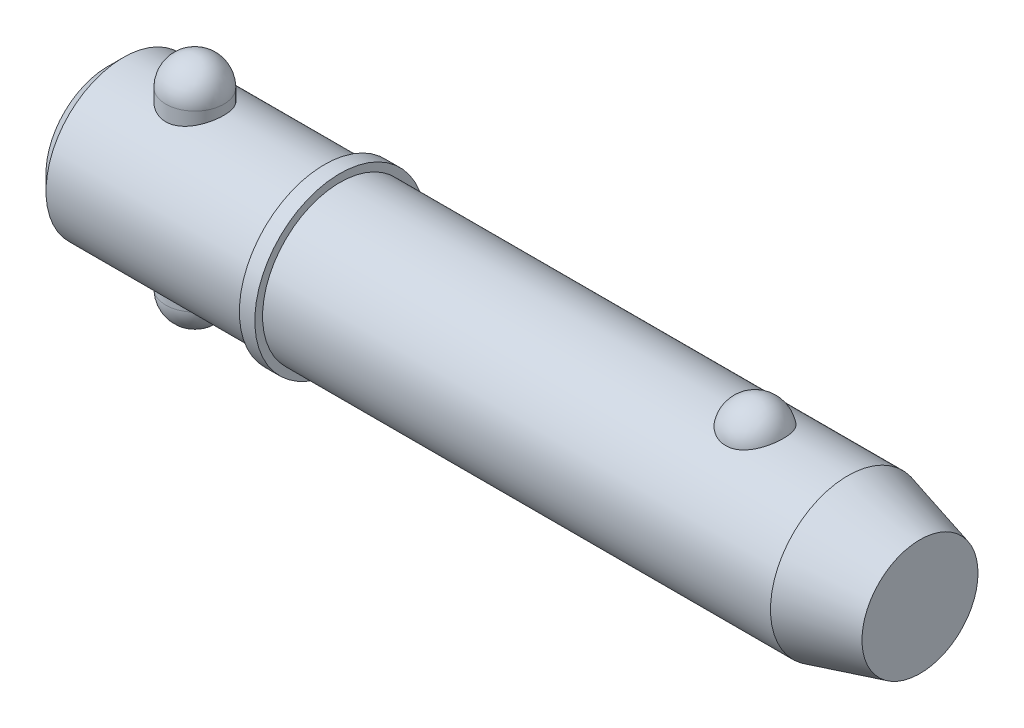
ISO-10303-21;
HEADER;
FILE_DESCRIPTION(('STEP AP214'),'2;1');
FILE_NAME('part.step','',(''),(''),'','','');
FILE_SCHEMA(('AUTOMOTIVE_DESIGN { 1 0 10303 214 1 1 1 1 }'));
ENDSEC;
DATA;
#1=APPLICATION_CONTEXT('core data for automotive mechanical design processes');
#2=APPLICATION_PROTOCOL_DEFINITION('international standard','automotive_design',2000,#1);
#3=PRODUCT_CONTEXT('',#1,'mechanical');
#4=PRODUCT('Part','Part','',(#3));
#5=PRODUCT_RELATED_PRODUCT_CATEGORY('part','',(#4));
#6=PRODUCT_DEFINITION_FORMATION('','',#4);
#7=PRODUCT_DEFINITION_CONTEXT('part definition',#1,'design');
#8=PRODUCT_DEFINITION('design','',#6,#7);
#9=PRODUCT_DEFINITION_SHAPE('','',#8);
#10=(LENGTH_UNIT() NAMED_UNIT(*) SI_UNIT(.MILLI.,.METRE.));
#11=(NAMED_UNIT(*) PLANE_ANGLE_UNIT() SI_UNIT($,.RADIAN.));
#12=(NAMED_UNIT(*) SI_UNIT($,.STERADIAN.) SOLID_ANGLE_UNIT());
#13=UNCERTAINTY_MEASURE_WITH_UNIT(LENGTH_MEASURE(1.E-05),#10,'distance_accuracy_value','');
#14=(GEOMETRIC_REPRESENTATION_CONTEXT(3) GLOBAL_UNCERTAINTY_ASSIGNED_CONTEXT((#13)) GLOBAL_UNIT_ASSIGNED_CONTEXT((#10,
#11,#12)) REPRESENTATION_CONTEXT('',''));
#15=CARTESIAN_POINT('',(0.,0.,0.));
#16=DIRECTION('',(0.,0.,1.));
#17=DIRECTION('',(1.,0.,0.));
#18=AXIS2_PLACEMENT_3D('',#15,#16,#17);
#19=CARTESIAN_POINT('',(14.28,19.05,0.));
#20=DIRECTION('',(0.,-1.,0.));
#21=DIRECTION('',(0.,0.,-1.));
#22=AXIS2_PLACEMENT_3D('',#19,#20,#21);
#23=CYLINDRICAL_SURFACE('',#22,4.76);
#24=CARTESIAN_POINT('',(14.28,-14.29,0.));
#25=DIRECTION('',(0.,-1.,0.));
#26=DIRECTION('',(0.,0.,-1.));
#27=AXIS2_PLACEMENT_3D('',#24,#25,#26);
#28=CIRCLE('',#27,4.76);
#29=CARTESIAN_POINT('',(14.28,-14.29,-4.76));
#30=VERTEX_POINT('',#29);
#31=EDGE_CURVE('P0_E10',#30,#30,#28,.F.);
#32=CARTESIAN_POINT('',(14.28,14.29,0.));
#33=DIRECTION('',(0.,-1.,0.));
#34=DIRECTION('',(0.,0.,-1.));
#35=AXIS2_PLACEMENT_3D('',#32,#33,#34);
#36=CIRCLE('',#35,4.76);
#37=CARTESIAN_POINT('',(14.28,14.29,-4.76));
#38=VERTEX_POINT('',#37);
#39=EDGE_CURVE('P0_E21',#38,#38,#36,.T.);
#40=CARTESIAN_POINT('',(14.28,-14.29,-4.76));
#41=CARTESIAN_POINT('',(14.28,-13.9922916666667,-4.76));
#42=CARTESIAN_POINT('',(14.28,-13.6945833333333,-4.76));
#43=CARTESIAN_POINT('',(14.28,-13.0991666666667,-4.76));
#44=CARTESIAN_POINT('',(14.28,-12.8014583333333,-4.76));
#45=CARTESIAN_POINT('',(14.28,-12.2060416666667,-4.76));
#46=CARTESIAN_POINT('',(14.28,-11.9083333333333,-4.76));
#47=CARTESIAN_POINT('',(14.28,-11.3129166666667,-4.76));
#48=CARTESIAN_POINT('',(14.28,-11.0152083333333,-4.76));
#49=CARTESIAN_POINT('',(14.28,-10.4197916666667,-4.76));
#50=CARTESIAN_POINT('',(14.28,-10.1220833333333,-4.76));
#51=CARTESIAN_POINT('',(14.28,-9.52666666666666,-4.76));
#52=CARTESIAN_POINT('',(14.28,-9.22895833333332,-4.76));
#53=CARTESIAN_POINT('',(14.28,-8.63354166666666,-4.76));
#54=CARTESIAN_POINT('',(14.28,-8.33583333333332,-4.76));
#55=CARTESIAN_POINT('',(14.28,-7.74041666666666,-4.76));
#56=CARTESIAN_POINT('',(14.28,-7.44270833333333,-4.76));
#57=CARTESIAN_POINT('',(14.28,-6.84729166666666,-4.76));
#58=CARTESIAN_POINT('',(14.28,-6.54958333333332,-4.76));
#59=CARTESIAN_POINT('',(14.28,-5.95416666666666,-4.76));
#60=CARTESIAN_POINT('',(14.28,-5.65645833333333,-4.76));
#61=CARTESIAN_POINT('',(14.28,-5.06104166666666,-4.76));
#62=CARTESIAN_POINT('',(14.28,-4.76333333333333,-4.76));
#63=CARTESIAN_POINT('',(14.28,-4.16791666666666,-4.76));
#64=CARTESIAN_POINT('',(14.28,-3.87020833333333,-4.76));
#65=CARTESIAN_POINT('',(14.28,-3.27479166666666,-4.76));
#66=CARTESIAN_POINT('',(14.28,-2.97708333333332,-4.76));
#67=CARTESIAN_POINT('',(14.28,-2.38166666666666,-4.76));
#68=CARTESIAN_POINT('',(14.28,-2.08395833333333,-4.76));
#69=CARTESIAN_POINT('',(14.28,-1.48854166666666,-4.76));
#70=CARTESIAN_POINT('',(14.28,-1.19083333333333,-4.76));
#71=CARTESIAN_POINT('',(14.28,-0.595416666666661,-4.76));
#72=CARTESIAN_POINT('',(14.28,-0.297708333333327,-4.76));
#73=CARTESIAN_POINT('',(14.28,0.297708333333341,-4.76));
#74=CARTESIAN_POINT('',(14.28,0.595416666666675,-4.76));
#75=CARTESIAN_POINT('',(14.28,1.19083333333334,-4.76));
#76=CARTESIAN_POINT('',(14.28,1.48854166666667,-4.76));
#77=CARTESIAN_POINT('',(14.28,2.08395833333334,-4.76));
#78=CARTESIAN_POINT('',(14.28,2.38166666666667,-4.76));
#79=CARTESIAN_POINT('',(14.28,2.97708333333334,-4.76));
#80=CARTESIAN_POINT('',(14.28,3.27479166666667,-4.76));
#81=CARTESIAN_POINT('',(14.28,3.87020833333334,-4.76));
#82=CARTESIAN_POINT('',(14.28,4.16791666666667,-4.76));
#83=CARTESIAN_POINT('',(14.28,4.76333333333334,-4.76));
#84=CARTESIAN_POINT('',(14.28,5.06104166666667,-4.76));
#85=CARTESIAN_POINT('',(14.28,5.65645833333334,-4.76));
#86=CARTESIAN_POINT('',(14.28,5.95416666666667,-4.76));
#87=CARTESIAN_POINT('',(14.28,6.54958333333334,-4.76));
#88=CARTESIAN_POINT('',(14.28,6.84729166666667,-4.76));
#89=CARTESIAN_POINT('',(14.28,7.44270833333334,-4.76));
#90=CARTESIAN_POINT('',(14.28,7.74041666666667,-4.76));
#91=CARTESIAN_POINT('',(14.28,8.33583333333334,-4.76));
#92=CARTESIAN_POINT('',(14.28,8.63354166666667,-4.76));
#93=CARTESIAN_POINT('',(14.28,9.22895833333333,-4.76));
#94=CARTESIAN_POINT('',(14.28,9.52666666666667,-4.76));
#95=CARTESIAN_POINT('',(14.28,10.1220833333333,-4.76));
#96=CARTESIAN_POINT('',(14.28,10.4197916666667,-4.76));
#97=CARTESIAN_POINT('',(14.28,11.0152083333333,-4.76));
#98=CARTESIAN_POINT('',(14.28,11.3129166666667,-4.76));
#99=CARTESIAN_POINT('',(14.28,11.9083333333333,-4.76));
#100=CARTESIAN_POINT('',(14.28,12.2060416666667,-4.76));
#101=CARTESIAN_POINT('',(14.28,12.8014583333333,-4.76));
#102=CARTESIAN_POINT('',(14.28,13.0991666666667,-4.76));
#103=CARTESIAN_POINT('',(14.28,13.6945833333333,-4.76));
#104=CARTESIAN_POINT('',(14.28,13.9922916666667,-4.76));
#105=CARTESIAN_POINT('',(14.28,14.29,-4.76));
#106=B_SPLINE_CURVE_WITH_KNOTS('',3,(#40,#41,#42,#43,#44,#45,#46,#47,#48,#49,#50,#51,#52,#53,
#54,#55,#56,#57,#58,#59,#60,#61,#62,#63,#64,#65,#66,#67,#68,#69,#70,#71,#72,#73,#74,#75,#76,#77,
#78,#79,#80,#81,#82,#83,#84,#85,#86,#87,#88,#89,#90,#91,#92,#93,#94,#95,#96,#97,#98,#99,#100,
#101,#102,#103,#104,#105),.UNSPECIFIED.,.F.,.F.,(4,2,2,2,2,2,2,2,2,2,2,2,2,2,2,2,2,2,2,2,2,2,2,
2,2,2,2,2,2,2,2,2,4),(0.,0.893125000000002,1.78625,2.67937499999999,3.5725,4.465625,5.35875,
6.25187499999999,7.145,8.038125,8.93125,9.82437499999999,10.7175,11.610625,12.50375,13.396875,
14.29,15.183125,16.07625,16.969375,17.8625,18.755625,19.64875,20.541875,21.435,22.328125,
23.22125,24.114375,25.0075,25.900625,26.79375,27.686875,28.58),.UNSPECIFIED.);
#107=EDGE_CURVE('P0_BSEAM14',#30,#38,#106,.T.);
#108=ORIENTED_EDGE('',*,*,#31,.T.);
#109=ORIENTED_EDGE('',*,*,#39,.T.);
#110=ORIENTED_EDGE('',*,*,#107,.T.);
#111=ORIENTED_EDGE('',*,*,#107,.F.);
#112=EDGE_LOOP('',(#108,#110,#109,#111));
#113=FACE_BOUND('',#112,.T.);
#114=ADVANCED_FACE('P0_F14',(#113),#23,.T.);
#115=CARTESIAN_POINT('',(14.28,-14.29,0.));
#116=DIRECTION('',(0.,0.,1.));
#117=DIRECTION('',(1.,0.,0.));
#118=AXIS2_PLACEMENT_3D('',#115,#116,#117);
#119=SPHERICAL_SURFACE('',#118,4.76);
#120=CARTESIAN_POINT('',(14.28,-14.29,0.));
#121=DIRECTION('',(0.,-1.,0.));
#122=DIRECTION('',(0.,0.,-1.));
#123=AXIS2_PLACEMENT_3D('',#120,#121,#122);
#124=SPHERICAL_SURFACE('',#123,4.76);
#125=ORIENTED_EDGE('',*,*,#31,.F.);
#126=EDGE_LOOP('',(#125));
#127=FACE_BOUND('',#126,.T.);
#128=ADVANCED_FACE('P0_F29',(#127),#124,.T.);
#129=CARTESIAN_POINT('',(14.28,14.29,0.));
#130=DIRECTION('',(0.,0.,1.));
#131=DIRECTION('',(1.,0.,0.));
#132=AXIS2_PLACEMENT_3D('',#129,#130,#131);
#133=SPHERICAL_SURFACE('',#132,4.76);
#134=CARTESIAN_POINT('',(14.28,14.29,0.));
#135=DIRECTION('',(0.,-1.,0.));
#136=DIRECTION('',(0.,0.,-1.));
#137=AXIS2_PLACEMENT_3D('',#134,#135,#136);
#138=SPHERICAL_SURFACE('',#137,4.76);
#139=ORIENTED_EDGE('',*,*,#39,.F.);
#140=EDGE_LOOP('',(#139));
#141=FACE_BOUND('',#140,.T.);
#142=ADVANCED_FACE('P0_F16',(#141),#138,.T.);
#143=CLOSED_SHELL('',(#114,#128,#142));
#144=MANIFOLD_SOLID_BREP('P0_B1',#143);
#145=CARTESIAN_POINT('',(0.,0.,0.));
#146=DIRECTION('',(1.,0.,0.));
#147=DIRECTION('',(0.,0.,-1.));
#148=AXIS2_PLACEMENT_3D('',#145,#146,#147);
#149=CYLINDRICAL_SURFACE('',#148,12.7);
#150=CARTESIAN_POINT('',(121.500738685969,0.,0.));
#151=DIRECTION('',(1.,0.,0.));
#152=DIRECTION('',(0.,0.,-1.));
#153=AXIS2_PLACEMENT_3D('',#150,#151,#152);
#154=CIRCLE('',#153,12.7);
#155=CARTESIAN_POINT('',(121.500738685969,0.,-12.7));
#156=VERTEX_POINT('',#155);
#157=EDGE_CURVE('P1_E81',#156,#156,#154,.T.);
#158=ORIENTED_EDGE('',*,*,#157,.F.);
#159=EDGE_LOOP('',(#158));
#160=FACE_BOUND('',#159,.T.);
#161=CARTESIAN_POINT('',(38.1,0.,0.));
#162=DIRECTION('',(1.,0.,0.));
#163=DIRECTION('',(0.,0.,-1.));
#164=AXIS2_PLACEMENT_3D('',#161,#162,#163);
#165=CIRCLE('',#164,12.7);
#166=CARTESIAN_POINT('',(38.1,0.,-12.7));
#167=VERTEX_POINT('',#166);
#168=EDGE_CURVE('P1_E85',#167,#167,#165,.T.);
#169=ORIENTED_EDGE('',*,*,#168,.T.);
#170=EDGE_LOOP('',(#169));
#171=FACE_BOUND('',#170,.T.);
#172=CARTESIAN_POINT('',(106.260042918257,11.7500437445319,4.81938502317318));
#173=CARTESIAN_POINT('',(106.135088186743,11.7500430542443,4.81938571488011));
#174=CARTESIAN_POINT('',(106.010144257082,11.7520975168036,4.81438658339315));
#175=CARTESIAN_POINT('',(105.761142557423,11.760253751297,4.79442904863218));
#176=CARTESIAN_POINT('',(105.637085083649,11.7663568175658,4.77946746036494));
#177=CARTESIAN_POINT('',(105.390901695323,11.7824262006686,4.7397141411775));
#178=CARTESIAN_POINT('',(105.268774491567,11.7923898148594,4.71492928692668));
#179=CARTESIAN_POINT('',(105.027187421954,11.8158938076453,4.65571340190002));
#180=CARTESIAN_POINT('',(104.90772859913,11.8294355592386,4.6212786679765));
#181=CARTESIAN_POINT('',(104.672557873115,11.8596812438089,4.54309502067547));
#182=CARTESIAN_POINT('',(104.556839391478,11.8763792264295,4.49936361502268));
#183=CARTESIAN_POINT('',(104.329653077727,11.9124878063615,4.40287235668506));
#184=CARTESIAN_POINT('',(104.218186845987,11.9318994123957,4.35010914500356));
#185=CARTESIAN_POINT('',(103.891278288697,11.9934256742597,4.17881316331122));
#186=CARTESIAN_POINT('',(103.683127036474,12.038858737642,4.04720756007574));
#187=CARTESIAN_POINT('',(103.285850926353,12.1352173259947,3.748564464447));
#188=CARTESIAN_POINT('',(103.097443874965,12.1862630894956,3.58061821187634));
#189=CARTESIAN_POINT('',(102.750521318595,12.2875163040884,3.21600758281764));
#190=CARTESIAN_POINT('',(102.592011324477,12.3377235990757,3.0193379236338));
#191=CARTESIAN_POINT('',(102.30168878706,12.434492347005,2.592916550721));
#192=CARTESIAN_POINT('',(102.171376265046,12.4807925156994,2.36208286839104));
#193=CARTESIAN_POINT('',(101.949407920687,12.5623454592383,1.88070399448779));
#194=CARTESIAN_POINT('',(101.857755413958,12.5975972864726,1.63015711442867));
#195=CARTESIAN_POINT('',(101.714046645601,12.6538414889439,1.1129886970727));
#196=CARTESIAN_POINT('',(101.662499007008,12.6746503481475,0.846205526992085));
#197=CARTESIAN_POINT('',(101.601977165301,12.699153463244,0.307085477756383));
#198=CARTESIAN_POINT('',(101.593001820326,12.7028481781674,0.0347487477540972));
#199=CARTESIAN_POINT('',(101.617731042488,12.6927785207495,-0.506073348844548));
#200=CARTESIAN_POINT('',(101.651189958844,12.6791146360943,-0.77457186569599));
#201=CARTESIAN_POINT('',(101.759687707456,12.635882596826,-1.30170246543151));
#202=CARTESIAN_POINT('',(101.83472729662,12.606314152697,-1.5603343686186));
#203=CARTESIAN_POINT('',(102.02500006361,12.5342328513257,-2.06083899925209));
#204=CARTESIAN_POINT('',(102.140287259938,12.4917026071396,-2.3026886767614));
#205=CARTESIAN_POINT('',(102.408704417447,12.3981123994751,-2.76259600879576));
#206=CARTESIAN_POINT('',(102.561837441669,12.3470517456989,-2.98065173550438));
#207=CARTESIAN_POINT('',(102.903507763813,12.2416045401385,-3.38786328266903));
#208=CARTESIAN_POINT('',(103.092201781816,12.1872040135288,-3.57688418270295));
#209=CARTESIAN_POINT('',(103.500239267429,12.0814086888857,-3.91941073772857));
#210=CARTESIAN_POINT('',(103.719580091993,12.0300136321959,-4.07291945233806));
#211=CARTESIAN_POINT('',(104.178375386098,11.9373542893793,-4.33691289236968));
#212=CARTESIAN_POINT('',(104.417304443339,11.8958982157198,-4.44824125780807));
#213=CARTESIAN_POINT('',(104.91243761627,11.8268116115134,-4.62881985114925));
#214=CARTESIAN_POINT('',(105.168635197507,11.7991758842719,-4.69808589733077));
#215=CARTESIAN_POINT('',(105.677164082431,11.7622209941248,-4.78983181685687));
#216=CARTESIAN_POINT('',(105.929041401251,11.7520502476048,-4.81449025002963));
#217=CARTESIAN_POINT('',(106.433573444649,11.7485796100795,-4.82295735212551));
#218=CARTESIAN_POINT('',(106.686228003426,11.7552763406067,-4.80677420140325));
#219=CARTESIAN_POINT('',(107.176834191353,11.7842584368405,-4.73525430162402));
#220=CARTESIAN_POINT('',(107.414998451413,11.8060486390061,-4.68116061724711));
#221=CARTESIAN_POINT('',(107.878489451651,11.8622750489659,-4.53678133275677));
#222=CARTESIAN_POINT('',(108.103815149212,11.8967122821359,-4.44649279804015));
#223=CARTESIAN_POINT('',(108.540801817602,11.9754603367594,-4.2298761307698));
#224=CARTESIAN_POINT('',(108.752057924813,12.0199699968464,-4.10280539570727));
#225=CARTESIAN_POINT('',(109.150601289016,12.1138028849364,-3.81685409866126));
#226=CARTESIAN_POINT('',(109.337883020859,12.163127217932,-3.65796622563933));
#227=CARTESIAN_POINT('',(109.693350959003,12.2642343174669,-3.30364864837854));
#228=CARTESIAN_POINT('',(109.860111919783,12.3160165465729,-3.10678783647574));
#229=CARTESIAN_POINT('',(110.159579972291,12.4142566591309,-2.68748409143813));
#230=CARTESIAN_POINT('',(110.292280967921,12.4607135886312,-2.46503658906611));
#231=CARTESIAN_POINT('',(110.524691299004,12.5450236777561,-1.99289519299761));
#232=CARTESIAN_POINT('',(110.623215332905,12.5825557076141,-1.74255918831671));
#233=CARTESIAN_POINT('',(110.779227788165,12.6431720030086,-1.22773734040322));
#234=CARTESIAN_POINT('',(110.836715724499,12.6662560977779,-0.963251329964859));
#235=CARTESIAN_POINT('',(110.909544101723,12.6956486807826,-0.427355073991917));
#236=CARTESIAN_POINT('',(110.924837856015,12.7019385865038,-0.1559374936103));
#237=CARTESIAN_POINT('',(110.912779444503,12.6970201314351,0.385928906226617));
#238=CARTESIAN_POINT('',(110.88542805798,12.6858120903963,0.656377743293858));
#239=CARTESIAN_POINT('',(110.813060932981,12.6568455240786,1.05454017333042));
#240=CARTESIAN_POINT('',(110.783796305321,12.6451962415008,1.18577850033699));
#241=CARTESIAN_POINT('',(110.715022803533,12.6181819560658,1.4451380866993));
#242=CARTESIAN_POINT('',(110.675517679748,12.6028183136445,1.57326046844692));
#243=CARTESIAN_POINT('',(110.586439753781,12.5687547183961,1.82554978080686));
#244=CARTESIAN_POINT('',(110.536862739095,12.5500533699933,1.9497150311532));
#245=CARTESIAN_POINT('',(110.42792115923,12.5098093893,2.1931437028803));
#246=CARTESIAN_POINT('',(110.368560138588,12.4882677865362,2.31240887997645));
#247=CARTESIAN_POINT('',(110.23997128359,12.4427679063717,2.54593031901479));
#248=CARTESIAN_POINT('',(110.170688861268,12.4187964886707,2.66015396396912));
#249=CARTESIAN_POINT('',(110.022903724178,12.3691892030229,2.88202659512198));
#250=CARTESIAN_POINT('',(109.944404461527,12.3435539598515,2.98967802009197));
#251=CARTESIAN_POINT('',(109.778550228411,12.2912955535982,3.19774385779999));
#252=CARTESIAN_POINT('',(109.691191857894,12.2646720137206,3.29815546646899));
#253=CARTESIAN_POINT('',(109.508161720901,12.2111945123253,3.49095035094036));
#254=CARTESIAN_POINT('',(109.412493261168,12.1843406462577,3.58333679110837));
#255=CARTESIAN_POINT('',(109.213627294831,12.1312249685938,3.75922876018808));
#256=CARTESIAN_POINT('',(109.110450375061,12.104961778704,3.84275713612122));
#257=CARTESIAN_POINT('',(108.89701336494,12.0537284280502,4.00056406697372));
#258=CARTESIAN_POINT('',(108.786756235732,12.028757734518,4.07484645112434));
#259=CARTESIAN_POINT('',(108.559755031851,11.9808306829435,4.21367959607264));
#260=CARTESIAN_POINT('',(108.443006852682,11.9578756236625,4.27822410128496));
#261=CARTESIAN_POINT('',(108.20394258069,11.9147184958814,4.39698483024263));
#262=CARTESIAN_POINT('',(108.081628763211,11.894515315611,4.45120522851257));
#263=CARTESIAN_POINT('',(107.822952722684,11.8561129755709,4.55255353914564));
#264=CARTESIAN_POINT('',(107.686223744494,11.8381764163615,4.59884858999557));
#265=CARTESIAN_POINT('',(107.408608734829,11.8069093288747,4.67853897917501));
#266=CARTESIAN_POINT('',(107.267724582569,11.7935767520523,4.71194005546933));
#267=CARTESIAN_POINT('',(106.98309446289,11.7720277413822,4.76552188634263));
#268=CARTESIAN_POINT('',(106.839348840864,11.7638106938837,4.78570422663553));
#269=CARTESIAN_POINT('',(106.550411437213,11.7528195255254,4.81263433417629));
#270=CARTESIAN_POINT('',(106.405219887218,11.7500445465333,4.81938421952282));
#271=CARTESIAN_POINT('',(106.260042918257,11.7500437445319,4.81938502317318));
#272=B_SPLINE_CURVE_WITH_KNOTS('',3,(#172,#173,#174,#175,#176,#177,#178,#179,#180,#181,#182,
#183,#184,#185,#186,#187,#188,#189,#190,#191,#192,#193,#194,#195,#196,#197,#198,#199,#200,#201,
#202,#203,#204,#205,#206,#207,#208,#209,#210,#211,#212,#213,#214,#215,#216,#217,#218,#219,#220,
#221,#222,#223,#224,#225,#226,#227,#228,#229,#230,#231,#232,#233,#234,#235,#236,#237,#238,#239,
#240,#241,#242,#243,#244,#245,#246,#247,#248,#249,#250,#251,#252,#253,#254,#255,#256,#257,#258,
#259,#260,#261,#262,#263,#264,#265,#266,#267,#268,#269,#270,#271),.UNSPECIFIED.,.T.,.F.,(4,2,2,
2,2,2,2,2,2,2,2,2,2,2,2,2,2,2,2,2,2,2,2,2,2,2,2,2,2,2,2,2,2,2,2,2,2,2,2,2,2,2,2,2,2,2,2,2,2,4),
(0.,0.374729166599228,0.749578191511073,1.12416526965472,1.49889629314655,1.87292776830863,
2.24709865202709,2.99481328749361,3.76399449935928,4.53331735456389,5.3368391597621,
6.14042986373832,6.95405296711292,7.76765424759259,8.57656703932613,9.38549455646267,
10.1955119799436,11.0055949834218,11.8193353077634,12.6330054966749,13.4294141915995,
14.2255231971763,14.9815786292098,15.7374826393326,16.4696948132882,17.2019663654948,
17.9501979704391,18.6986017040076,19.484470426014,20.2704797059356,21.0815215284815,
21.8925729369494,22.7045213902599,23.5164550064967,23.9209608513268,24.3253187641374,
24.7298461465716,25.1342272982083,25.54092555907,25.9474719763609,26.3541750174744,
26.7607169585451,27.1661834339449,27.5714814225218,27.9770386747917,28.3824315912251,
28.818120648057,29.2536155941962,29.6890582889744,30.1244323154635),.UNSPECIFIED.);
#273=CARTESIAN_POINT('',(106.260042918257,11.7500437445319,4.81938502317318));
#274=VERTEX_POINT('',#273);
#275=EDGE_CURVE('P1_E35',#274,#274,#272,.T.);
#276=ORIENTED_EDGE('',*,*,#275,.T.);
#277=EDGE_LOOP('',(#276));
#278=FACE_BOUND('',#277,.T.);
#279=ADVANCED_FACE('P1_F13',(#160,#171,#278),#149,.T.);
#280=CARTESIAN_POINT('',(0.,0.,0.));
#281=DIRECTION('',(-1.,0.,0.));
#282=DIRECTION('',(0.,0.,1.));
#283=AXIS2_PLACEMENT_3D('',#280,#281,#282);
#284=PLANE('',#283);
#285=CARTESIAN_POINT('',(0.,0.,0.));
#286=DIRECTION('',(1.,0.,0.));
#287=DIRECTION('',(0.,0.,-1.));
#288=AXIS2_PLACEMENT_3D('',#285,#286,#287);
#289=CIRCLE('',#288,10.16);
#290=CARTESIAN_POINT('',(0.,0.,-10.16));
#291=VERTEX_POINT('',#290);
#292=EDGE_CURVE('P1_E9',#291,#291,#289,.T.);
#293=ORIENTED_EDGE('',*,*,#292,.F.);
#294=EDGE_LOOP('',(#293));
#295=FACE_BOUND('',#294,.T.);
#296=ADVANCED_FACE('P1_F15',(#295),#284,.T.);
#297=CARTESIAN_POINT('',(2.53999999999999,0.,0.));
#298=DIRECTION('',(1.,0.,0.));
#299=DIRECTION('',(0.,0.,-1.));
#300=AXIS2_PLACEMENT_3D('',#297,#298,#299);
#301=CONICAL_SURFACE('',#300,12.7,0.78539816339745);
#302=ORIENTED_EDGE('',*,*,#292,.T.);
#303=EDGE_LOOP('',(#302));
#304=FACE_BOUND('',#303,.T.);
#305=CARTESIAN_POINT('',(2.53999999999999,0.,0.));
#306=DIRECTION('',(1.,0.,0.));
#307=DIRECTION('',(0.,0.,-1.));
#308=AXIS2_PLACEMENT_3D('',#305,#306,#307);
#309=CIRCLE('',#308,12.7);
#310=CARTESIAN_POINT('',(2.53999999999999,0.,-12.7));
#311=VERTEX_POINT('',#310);
#312=EDGE_CURVE('P1_E26',#311,#311,#309,.T.);
#313=ORIENTED_EDGE('',*,*,#312,.F.);
#314=EDGE_LOOP('',(#313));
#315=FACE_BOUND('',#314,.T.);
#316=ADVANCED_FACE('P1_F77',(#304,#315),#301,.T.);
#317=CARTESIAN_POINT('',(0.,0.,0.));
#318=DIRECTION('',(1.,0.,0.));
#319=DIRECTION('',(0.,0.,-1.));
#320=AXIS2_PLACEMENT_3D('',#317,#318,#319);
#321=CYLINDRICAL_SURFACE('',#320,12.7);
#322=CARTESIAN_POINT('',(14.28,-11.7742260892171,4.76));
#323=CARTESIAN_POINT('',(14.1514948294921,-11.7742255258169,4.76000061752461));
#324=CARTESIAN_POINT('',(14.0229980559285,-11.7763355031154,4.75479194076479));
#325=CARTESIAN_POINT('',(13.7669369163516,-11.7847043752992,4.73401198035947));
#326=CARTESIAN_POINT('',(13.6393728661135,-11.7909646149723,4.71843733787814));
#327=CARTESIAN_POINT('',(13.386226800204,-11.8074248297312,4.67709434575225));
#328=CARTESIAN_POINT('',(13.2606439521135,-11.8176231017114,4.65133040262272));
#329=CARTESIAN_POINT('',(13.0122434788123,-11.8416347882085,4.58985545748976));
#330=CARTESIAN_POINT('',(12.8894269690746,-11.8554496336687,4.55414051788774));
#331=CARTESIAN_POINT('',(12.6477622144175,-11.8862222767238,4.47320764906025));
#332=CARTESIAN_POINT('',(12.5289037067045,-11.9031710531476,4.4280169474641));
#333=CARTESIAN_POINT('',(12.2955059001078,-11.939736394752,4.32845291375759));
#334=CARTESIAN_POINT('',(12.1809682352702,-11.9593539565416,4.2740761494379));
#335=CARTESIAN_POINT('',(11.8448901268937,-12.0213893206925,4.09777237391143));
#336=CARTESIAN_POINT('',(11.6307077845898,-12.0670135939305,3.9626122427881));
#337=CARTESIAN_POINT('',(11.2179129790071,-12.1641514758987,3.65386230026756));
#338=CARTESIAN_POINT('',(11.0204399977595,-12.2158379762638,3.47881300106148));
#339=CARTESIAN_POINT('',(10.6568212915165,-12.3178468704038,3.09829182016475));
#340=CARTESIAN_POINT('',(10.4906822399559,-12.3681689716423,2.89281347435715));
#341=CARTESIAN_POINT('',(10.1890299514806,-12.4638367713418,2.44867909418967));
#342=CARTESIAN_POINT('',(10.054749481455,-12.5089552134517,2.20913281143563));
#343=CARTESIAN_POINT('',(9.82886079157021,-12.5870472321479,1.70885919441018));
#344=CARTESIAN_POINT('',(9.73723778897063,-12.620025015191,1.44813923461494));
#345=CARTESIAN_POINT('',(9.60324488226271,-12.6688874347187,0.9248423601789));
#346=CARTESIAN_POINT('',(9.55892269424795,-12.6854474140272,0.662829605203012));
#347=CARTESIAN_POINT('',(9.5145335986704,-12.7020320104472,0.134596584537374));
#348=CARTESIAN_POINT('',(9.5144523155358,-12.7020619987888,-0.131622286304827));
#349=CARTESIAN_POINT('',(9.55741019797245,-12.6860129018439,-0.646717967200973));
#350=CARTESIAN_POINT('',(9.59831845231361,-12.6707298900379,-0.895801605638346));
#351=CARTESIAN_POINT('',(9.71850987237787,-12.6268158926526,-1.38327219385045));
#352=CARTESIAN_POINT('',(9.79779575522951,-12.5981839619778,-1.62165838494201));
#353=CARTESIAN_POINT('',(9.99348296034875,-12.5298894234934,-2.08508424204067));
#354=CARTESIAN_POINT('',(10.110407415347,-12.4900724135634,-2.30987931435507));
#355=CARTESIAN_POINT('',(10.3775896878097,-12.4034373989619,-2.7372158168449));
#356=CARTESIAN_POINT('',(10.5278582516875,-12.3566171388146,-2.93975004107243));
#357=CARTESIAN_POINT('',(10.8677318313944,-12.257571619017,-3.32936830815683));
#358=CARTESIAN_POINT('',(11.0591227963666,-12.2051903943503,-3.51485714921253));
#359=CARTESIAN_POINT('',(11.4706087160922,-12.1031155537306,-3.85170663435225));
#360=CARTESIAN_POINT('',(11.6907108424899,-12.0534226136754,-4.00305872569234));
#361=CARTESIAN_POINT('',(12.1596597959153,-11.9613684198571,-4.27038218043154));
#362=CARTESIAN_POINT('',(12.4090353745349,-11.9191939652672,-4.38549550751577));
#363=CARTESIAN_POINT('',(12.9256290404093,-11.8491124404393,-4.57149117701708));
#364=CARTESIAN_POINT('',(13.1928371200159,-11.8211974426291,-4.64239810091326));
#365=CARTESIAN_POINT('',(13.7217488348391,-11.7846654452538,-4.73434137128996));
#366=CARTESIAN_POINT('',(13.9829438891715,-11.7750694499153,-4.75791141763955));
#367=CARTESIAN_POINT('',(14.5056760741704,-11.7734909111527,-4.76182097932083));
#368=CARTESIAN_POINT('',(14.7672131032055,-11.7815039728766,-4.74217128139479));
#369=CARTESIAN_POINT('',(15.2702140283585,-11.8132466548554,-4.66249544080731));
#370=CARTESIAN_POINT('',(15.5120417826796,-11.8362133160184,-4.60442726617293));
#371=CARTESIAN_POINT('',(15.9824097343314,-11.8943704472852,-4.45202868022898));
#372=CARTESIAN_POINT('',(16.2109472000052,-11.9295634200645,-4.35769084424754));
#373=CARTESIAN_POINT('',(16.6577741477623,-12.0098310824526,-4.13144368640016));
#374=CARTESIAN_POINT('',(16.8753590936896,-12.055226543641,-3.99825937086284));
#375=CARTESIAN_POINT('',(17.2859732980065,-12.150238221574,-3.69949845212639));
#376=CARTESIAN_POINT('',(17.4789935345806,-12.19985597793,-3.5339100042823));
#377=CARTESIAN_POINT('',(17.8477707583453,-12.3015434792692,-3.1624728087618));
#378=CARTESIAN_POINT('',(18.0216609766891,-12.3535695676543,-2.95473880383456));
#379=CARTESIAN_POINT('',(18.254545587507,-12.426745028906,-2.62277433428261));
#380=CARTESIAN_POINT('',(18.3275489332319,-12.4503382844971,-2.50865480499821));
#381=CARTESIAN_POINT('',(18.463723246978,-12.4952713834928,-2.27428971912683));
#382=CARTESIAN_POINT('',(18.5268984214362,-12.5166121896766,-2.15404681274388));
#383=CARTESIAN_POINT('',(18.6427140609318,-12.5563817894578,-1.90858448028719));
#384=CARTESIAN_POINT('',(18.6953855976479,-12.5748191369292,-1.78338108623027));
#385=CARTESIAN_POINT('',(18.7899337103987,-12.6083284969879,-1.52857834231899));
#386=CARTESIAN_POINT('',(18.8318147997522,-12.6234019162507,-1.39898085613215));
#387=CARTESIAN_POINT('',(18.9043819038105,-12.6497495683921,-1.13633254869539));
#388=CARTESIAN_POINT('',(18.9350698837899,-12.6610244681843,-1.00328233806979));
#389=CARTESIAN_POINT('',(18.9849303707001,-12.6794412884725,-0.734761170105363));
#390=CARTESIAN_POINT('',(19.0041035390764,-12.6865834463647,-0.59929035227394));
#391=CARTESIAN_POINT('',(19.0299427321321,-12.6962286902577,-0.335006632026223));
#392=CARTESIAN_POINT('',(19.0372742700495,-12.698978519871,-0.206267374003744));
#393=CARTESIAN_POINT('',(19.0414668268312,-12.7005496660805,0.0514515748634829));
#394=CARTESIAN_POINT('',(19.038324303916,-12.69936965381,0.180431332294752));
#395=CARTESIAN_POINT('',(19.0215965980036,-12.6931114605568,0.437551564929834));
#396=CARTESIAN_POINT('',(19.0080165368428,-12.6880351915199,0.565692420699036));
#397=CARTESIAN_POINT('',(18.9705519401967,-12.6741222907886,0.820297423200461));
#398=CARTESIAN_POINT('',(18.9466635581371,-12.665284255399,0.946760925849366));
#399=CARTESIAN_POINT('',(18.8895279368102,-12.6443449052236,1.19395899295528));
#400=CARTESIAN_POINT('',(18.8565273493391,-12.6323299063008,1.3147578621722));
#401=CARTESIAN_POINT('',(18.781239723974,-12.6052503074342,1.55308888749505));
#402=CARTESIAN_POINT('',(18.738949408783,-12.5901846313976,1.67061987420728));
#403=CARTESIAN_POINT('',(18.5986461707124,-12.5409473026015,2.01714406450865));
#404=CARTESIAN_POINT('',(18.4871532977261,-12.502717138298,2.24027279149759));
#405=CARTESIAN_POINT('',(18.2262440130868,-12.4173042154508,2.6742599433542));
#406=CARTESIAN_POINT('',(18.0754310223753,-12.3698127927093,2.88420891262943));
#407=CARTESIAN_POINT('',(17.7421836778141,-12.271667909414,3.27675114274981));
#408=CARTESIAN_POINT('',(17.5597380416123,-12.2210133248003,3.45933459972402));
#409=CARTESIAN_POINT('',(17.2605468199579,-12.1452079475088,3.7138066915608));
#410=CARTESIAN_POINT('',(17.1535518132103,-12.119328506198,3.79719993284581));
#411=CARTESIAN_POINT('',(16.9326449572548,-12.0688597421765,3.95467398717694));
#412=CARTESIAN_POINT('',(16.8187356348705,-12.0442699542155,4.02875817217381));
#413=CARTESIAN_POINT('',(16.5846234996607,-11.9971053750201,4.16711104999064));
#414=CARTESIAN_POINT('',(16.4644172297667,-11.9745317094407,4.23137427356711));
#415=CARTESIAN_POINT('',(16.2185866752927,-11.9321360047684,4.34949041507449));
#416=CARTESIAN_POINT('',(16.09296473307,-11.9123127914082,4.40334777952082));
#417=CARTESIAN_POINT('',(15.8314769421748,-11.875268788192,4.50232278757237));
#418=CARTESIAN_POINT('',(15.6954035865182,-11.8582009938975,4.54695127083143));
#419=CARTESIAN_POINT('',(15.4194002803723,-11.8284328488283,4.62383807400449));
#420=CARTESIAN_POINT('',(15.2794720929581,-11.815730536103,4.6561019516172));
#421=CARTESIAN_POINT('',(14.9969657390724,-11.7951940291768,4.70788444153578));
#422=CARTESIAN_POINT('',(14.8543884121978,-11.7873583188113,4.72740702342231));
#423=CARTESIAN_POINT('',(14.5678704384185,-11.7768749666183,4.75346370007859));
#424=CARTESIAN_POINT('',(14.4239299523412,-11.7742267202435,4.75999930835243));
#425=CARTESIAN_POINT('',(14.28,-11.7742260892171,4.76));
#426=B_SPLINE_CURVE_WITH_KNOTS('',3,(#322,#323,#324,#325,#326,#327,#328,#329,#330,#331,#332,
#333,#334,#335,#336,#337,#338,#339,#340,#341,#342,#343,#344,#345,#346,#347,#348,#349,#350,#351,
#352,#353,#354,#355,#356,#357,#358,#359,#360,#361,#362,#363,#364,#365,#366,#367,#368,#369,#370,
#371,#372,#373,#374,#375,#376,#377,#378,#379,#380,#381,#382,#383,#384,#385,#386,#387,#388,#389,
#390,#391,#392,#393,#394,#395,#396,#397,#398,#399,#400,#401,#402,#403,#404,#405,#406,#407,#408,
#409,#410,#411,#412,#413,#414,#415,#416,#417,#418,#419,#420,#421,#422,#423,#424,#425),
.UNSPECIFIED.,.T.,.F.,(4,2,2,2,2,2,2,2,2,2,2,2,2,2,2,2,2,2,2,2,2,2,2,2,2,2,2,2,2,2,2,2,2,2,2,2,
2,2,2,2,2,2,2,2,2,2,2,2,2,2,2,4),(0.,0.385378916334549,0.770882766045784,1.15622008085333,
1.54171009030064,1.92610725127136,2.31064835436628,3.07917291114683,3.88239385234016,
4.68578566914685,5.51648193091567,6.34689010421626,7.14151420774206,7.93588010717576,
8.69098665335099,9.44614666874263,10.2122918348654,10.9786842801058,11.789876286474,
12.6012713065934,13.4306405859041,14.2595482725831,15.0427613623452,15.8257790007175,
16.5716820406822,17.3177378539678,18.0917395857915,18.8660247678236,19.6893332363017,
20.1014571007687,20.5134040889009,20.9241137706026,21.3346513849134,21.7451168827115,
22.1555587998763,22.542011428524,22.928594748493,23.3149884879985,23.7015265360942,
24.0784835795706,24.4555738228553,25.2091300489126,25.994347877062,26.7798463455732,
27.1937428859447,27.6074890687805,28.0214648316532,28.4352633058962,28.8672794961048,
29.299101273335,29.7307884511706,30.1624253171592),.UNSPECIFIED.);
#427=CARTESIAN_POINT('',(14.28,-11.7742260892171,4.76));
#428=VERTEX_POINT('',#427);
#429=EDGE_CURVE('P1_E17',#428,#428,#426,.T.);
#430=ORIENTED_EDGE('',*,*,#429,.F.);
#431=EDGE_LOOP('',(#430));
#432=FACE_BOUND('',#431,.T.);
#433=CARTESIAN_POINT('',(14.28,11.7742260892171,4.76));
#434=CARTESIAN_POINT('',(14.4085051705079,11.7742255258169,4.76000061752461));
#435=CARTESIAN_POINT('',(14.5370019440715,11.7763355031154,4.75479194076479));
#436=CARTESIAN_POINT('',(14.7930630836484,11.7847043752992,4.73401198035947));
#437=CARTESIAN_POINT('',(14.9206271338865,11.7909646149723,4.71843733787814));
#438=CARTESIAN_POINT('',(15.173773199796,11.8074248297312,4.67709434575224));
#439=CARTESIAN_POINT('',(15.2993560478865,11.8176231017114,4.65133040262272));
#440=CARTESIAN_POINT('',(15.5477565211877,11.8416347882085,4.58985545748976));
#441=CARTESIAN_POINT('',(15.6705730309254,11.8554496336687,4.55414051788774));
#442=CARTESIAN_POINT('',(15.9122377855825,11.8862222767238,4.47320764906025));
#443=CARTESIAN_POINT('',(16.0310962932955,11.9031710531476,4.4280169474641));
#444=CARTESIAN_POINT('',(16.2644940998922,11.939736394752,4.32845291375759));
#445=CARTESIAN_POINT('',(16.3790317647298,11.9593539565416,4.2740761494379));
#446=CARTESIAN_POINT('',(16.7151098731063,12.0213893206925,4.09777237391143));
#447=CARTESIAN_POINT('',(16.9292922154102,12.0670135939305,3.96261224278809));
#448=CARTESIAN_POINT('',(17.3420870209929,12.1641514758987,3.65386230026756));
#449=CARTESIAN_POINT('',(17.5395600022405,12.2158379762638,3.47881300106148));
#450=CARTESIAN_POINT('',(17.9031787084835,12.3178468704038,3.09829182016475));
#451=CARTESIAN_POINT('',(18.0693177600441,12.3681689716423,2.89281347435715));
#452=CARTESIAN_POINT('',(18.3709700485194,12.4638367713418,2.44867909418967));
#453=CARTESIAN_POINT('',(18.505250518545,12.5089552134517,2.20913281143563));
#454=CARTESIAN_POINT('',(18.7311392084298,12.5870472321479,1.70885919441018));
#455=CARTESIAN_POINT('',(18.8227622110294,12.620025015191,1.44813923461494));
#456=CARTESIAN_POINT('',(18.9567551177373,12.6688874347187,0.924842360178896));
#457=CARTESIAN_POINT('',(19.0010773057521,12.6854474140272,0.662829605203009));
#458=CARTESIAN_POINT('',(19.0454664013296,12.7020320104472,0.134596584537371));
#459=CARTESIAN_POINT('',(19.0455476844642,12.7020619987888,-0.13162228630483));
#460=CARTESIAN_POINT('',(19.0025898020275,12.6860129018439,-0.646717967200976));
#461=CARTESIAN_POINT('',(18.9616815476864,12.6707298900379,-0.89580160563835));
#462=CARTESIAN_POINT('',(18.8414901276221,12.6268158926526,-1.38327219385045));
#463=CARTESIAN_POINT('',(18.7622042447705,12.5981839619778,-1.62165838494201));
#464=CARTESIAN_POINT('',(18.5665170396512,12.5298894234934,-2.08508424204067));
#465=CARTESIAN_POINT('',(18.449592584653,12.4900724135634,-2.30987931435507));
#466=CARTESIAN_POINT('',(18.1824103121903,12.4034373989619,-2.7372158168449));
#467=CARTESIAN_POINT('',(18.0321417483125,12.3566171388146,-2.93975004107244));
#468=CARTESIAN_POINT('',(17.6922681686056,12.257571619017,-3.32936830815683));
#469=CARTESIAN_POINT('',(17.5008772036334,12.2051903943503,-3.51485714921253));
#470=CARTESIAN_POINT('',(17.0893912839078,12.1031155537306,-3.85170663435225));
#471=CARTESIAN_POINT('',(16.8692891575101,12.0534226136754,-4.00305872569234));
#472=CARTESIAN_POINT('',(16.4003402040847,11.9613684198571,-4.27038218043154));
#473=CARTESIAN_POINT('',(16.1509646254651,11.9191939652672,-4.38549550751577));
#474=CARTESIAN_POINT('',(15.6343709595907,11.8491124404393,-4.57149117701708));
#475=CARTESIAN_POINT('',(15.367162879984,11.8211974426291,-4.64239810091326));
#476=CARTESIAN_POINT('',(14.8382511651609,11.7846654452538,-4.73434137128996));
#477=CARTESIAN_POINT('',(14.5770561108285,11.7750694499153,-4.75791141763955));
#478=CARTESIAN_POINT('',(14.0543239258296,11.7734909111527,-4.76182097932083));
#479=CARTESIAN_POINT('',(13.7927868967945,11.7815039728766,-4.74217128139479));
#480=CARTESIAN_POINT('',(13.2897859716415,11.8132466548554,-4.66249544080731));
#481=CARTESIAN_POINT('',(13.0479582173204,11.8362133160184,-4.60442726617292));
#482=CARTESIAN_POINT('',(12.5775902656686,11.8943704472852,-4.45202868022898));
#483=CARTESIAN_POINT('',(12.3490527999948,11.9295634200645,-4.35769084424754));
#484=CARTESIAN_POINT('',(11.9022258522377,12.0098310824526,-4.13144368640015));
#485=CARTESIAN_POINT('',(11.6846409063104,12.055226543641,-3.99825937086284));
#486=CARTESIAN_POINT('',(11.2740267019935,12.150238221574,-3.69949845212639));
#487=CARTESIAN_POINT('',(11.0810064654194,12.19985597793,-3.5339100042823));
#488=CARTESIAN_POINT('',(10.7122292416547,12.3015434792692,-3.1624728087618));
#489=CARTESIAN_POINT('',(10.5383390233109,12.3535695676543,-2.95473880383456));
#490=CARTESIAN_POINT('',(10.305454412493,12.426745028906,-2.6227743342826));
#491=CARTESIAN_POINT('',(10.2324510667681,12.4503382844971,-2.50865480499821));
#492=CARTESIAN_POINT('',(10.096276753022,12.4952713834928,-2.27428971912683));
#493=CARTESIAN_POINT('',(10.0331015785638,12.5166121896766,-2.15404681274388));
#494=CARTESIAN_POINT('',(9.91728593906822,12.5563817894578,-1.90858448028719));
#495=CARTESIAN_POINT('',(9.8646144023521,12.5748191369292,-1.78338108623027));
#496=CARTESIAN_POINT('',(9.77006628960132,12.6083284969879,-1.52857834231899));
#497=CARTESIAN_POINT('',(9.72818520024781,12.6234019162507,-1.39898085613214));
#498=CARTESIAN_POINT('',(9.65561809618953,12.6497495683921,-1.13633254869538));
#499=CARTESIAN_POINT('',(9.62493011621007,12.6610244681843,-1.00328233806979));
#500=CARTESIAN_POINT('',(9.57506962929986,12.6794412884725,-0.734761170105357));
#501=CARTESIAN_POINT('',(9.55589646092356,12.6865834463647,-0.599290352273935));
#502=CARTESIAN_POINT('',(9.53005726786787,12.6962286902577,-0.335006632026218));
#503=CARTESIAN_POINT('',(9.52272572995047,12.698978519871,-0.20626737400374));
#504=CARTESIAN_POINT('',(9.51853317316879,12.7005496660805,0.0514515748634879));
#505=CARTESIAN_POINT('',(9.52167569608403,12.69936965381,0.180431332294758));
#506=CARTESIAN_POINT('',(9.53840340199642,12.6931114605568,0.43755156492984));
#507=CARTESIAN_POINT('',(9.55198346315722,12.6880351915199,0.565692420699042));
#508=CARTESIAN_POINT('',(9.58944805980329,12.6741222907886,0.820297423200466));
#509=CARTESIAN_POINT('',(9.61333644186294,12.665284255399,0.946760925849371));
#510=CARTESIAN_POINT('',(9.67047206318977,12.6443449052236,1.19395899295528));
#511=CARTESIAN_POINT('',(9.7034726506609,12.6323299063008,1.31475786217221));
#512=CARTESIAN_POINT('',(9.77876027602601,12.6052503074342,1.55308888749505));
#513=CARTESIAN_POINT('',(9.82105059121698,12.5901846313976,1.67061987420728));
#514=CARTESIAN_POINT('',(9.96135382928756,12.5409473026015,2.01714406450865));
#515=CARTESIAN_POINT('',(10.0728467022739,12.502717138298,2.24027279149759));
#516=CARTESIAN_POINT('',(10.3337559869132,12.4173042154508,2.6742599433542));
#517=CARTESIAN_POINT('',(10.4845689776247,12.3698127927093,2.88420891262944));
#518=CARTESIAN_POINT('',(10.8178163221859,12.271667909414,3.27675114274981));
#519=CARTESIAN_POINT('',(11.0002619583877,12.2210133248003,3.45933459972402));
#520=CARTESIAN_POINT('',(11.2994531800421,12.1452079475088,3.7138066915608));
#521=CARTESIAN_POINT('',(11.4064481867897,12.119328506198,3.79719993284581));
#522=CARTESIAN_POINT('',(11.6273550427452,12.0688597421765,3.95467398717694));
#523=CARTESIAN_POINT('',(11.7412643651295,12.0442699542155,4.02875817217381));
#524=CARTESIAN_POINT('',(11.9753765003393,11.9971053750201,4.16711104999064));
#525=CARTESIAN_POINT('',(12.0955827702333,11.9745317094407,4.23137427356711));
#526=CARTESIAN_POINT('',(12.3414133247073,11.9321360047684,4.34949041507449));
#527=CARTESIAN_POINT('',(12.46703526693,11.9123127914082,4.40334777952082));
#528=CARTESIAN_POINT('',(12.7285230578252,11.875268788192,4.50232278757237));
#529=CARTESIAN_POINT('',(12.8645964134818,11.8582009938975,4.54695127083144));
#530=CARTESIAN_POINT('',(13.1405997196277,11.8284328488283,4.62383807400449));
#531=CARTESIAN_POINT('',(13.2805279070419,11.815730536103,4.6561019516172));
#532=CARTESIAN_POINT('',(13.5630342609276,11.7951940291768,4.70788444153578));
#533=CARTESIAN_POINT('',(13.7056115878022,11.7873583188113,4.72740702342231));
#534=CARTESIAN_POINT('',(13.9921295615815,11.7768749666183,4.75346370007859));
#535=CARTESIAN_POINT('',(14.1360700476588,11.7742267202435,4.75999930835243));
#536=CARTESIAN_POINT('',(14.28,11.7742260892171,4.76));
#537=B_SPLINE_CURVE_WITH_KNOTS('',3,(#433,#434,#435,#436,#437,#438,#439,#440,#441,#442,#443,
#444,#445,#446,#447,#448,#449,#450,#451,#452,#453,#454,#455,#456,#457,#458,#459,#460,#461,#462,
#463,#464,#465,#466,#467,#468,#469,#470,#471,#472,#473,#474,#475,#476,#477,#478,#479,#480,#481,
#482,#483,#484,#485,#486,#487,#488,#489,#490,#491,#492,#493,#494,#495,#496,#497,#498,#499,#500,
#501,#502,#503,#504,#505,#506,#507,#508,#509,#510,#511,#512,#513,#514,#515,#516,#517,#518,#519,
#520,#521,#522,#523,#524,#525,#526,#527,#528,#529,#530,#531,#532,#533,#534,#535,#536),
.UNSPECIFIED.,.T.,.F.,(4,2,2,2,2,2,2,2,2,2,2,2,2,2,2,2,2,2,2,2,2,2,2,2,2,2,2,2,2,2,2,2,2,2,2,2,
2,2,2,2,2,2,2,2,2,2,2,2,2,2,2,4),(0.,0.385378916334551,0.770882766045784,1.15622008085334,
1.54171009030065,1.92610725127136,2.31064835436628,3.07917291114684,3.88239385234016,
4.68578566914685,5.51648193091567,6.34689010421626,7.14151420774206,7.93588010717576,
8.690986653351,9.44614666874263,10.2122918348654,10.9786842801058,11.789876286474,
12.6012713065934,13.4306405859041,14.2595482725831,15.0427613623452,15.8257790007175,
16.5716820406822,17.3177378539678,18.0917395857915,18.8660247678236,19.6893332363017,
20.1014571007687,20.5134040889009,20.9241137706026,21.3346513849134,21.7451168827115,
22.1555587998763,22.542011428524,22.928594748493,23.3149884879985,23.7015265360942,
24.0784835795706,24.4555738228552,25.2091300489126,25.994347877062,26.7798463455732,
27.1937428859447,27.6074890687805,28.0214648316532,28.4352633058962,28.8672794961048,
29.299101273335,29.7307884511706,30.1624253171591),.UNSPECIFIED.);
#538=CARTESIAN_POINT('',(14.28,11.7742260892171,4.76));
#539=VERTEX_POINT('',#538);
#540=EDGE_CURVE('P1_E43',#539,#539,#537,.T.);
#541=ORIENTED_EDGE('',*,*,#540,.F.);
#542=EDGE_LOOP('',(#541));
#543=FACE_BOUND('',#542,.T.);
#544=ORIENTED_EDGE('',*,*,#312,.T.);
#545=EDGE_LOOP('',(#544));
#546=FACE_BOUND('',#545,.T.);
#547=CARTESIAN_POINT('',(35.56,0.,0.));
#548=DIRECTION('',(1.,0.,0.));
#549=DIRECTION('',(0.,0.,-1.));
#550=AXIS2_PLACEMENT_3D('',#547,#548,#549);
#551=CIRCLE('',#550,12.7);
#552=CARTESIAN_POINT('',(35.56,0.,-12.7));
#553=VERTEX_POINT('',#552);
#554=EDGE_CURVE('P1_E31',#553,#553,#551,.T.);
#555=ORIENTED_EDGE('',*,*,#554,.F.);
#556=EDGE_LOOP('',(#555));
#557=FACE_BOUND('',#556,.T.);
#558=ADVANCED_FACE('P1_F103',(#432,#543,#546,#557),#321,.T.);
#559=CARTESIAN_POINT('',(35.56,12.7,0.));
#560=DIRECTION('',(-1.,0.,0.));
#561=DIRECTION('',(0.,0.,1.));
#562=AXIS2_PLACEMENT_3D('',#559,#560,#561);
#563=PLANE('',#562);
#564=ORIENTED_EDGE('',*,*,#554,.T.);
#565=EDGE_LOOP('',(#564));
#566=FACE_BOUND('',#565,.T.);
#567=CARTESIAN_POINT('',(35.56,0.,0.));
#568=DIRECTION('',(1.,0.,0.));
#569=DIRECTION('',(0.,0.,-1.));
#570=AXIS2_PLACEMENT_3D('',#567,#568,#569);
#571=CIRCLE('',#570,13.97);
#572=CARTESIAN_POINT('',(35.56,0.,-13.97));
#573=VERTEX_POINT('',#572);
#574=EDGE_CURVE('P1_E91',#573,#573,#571,.T.);
#575=ORIENTED_EDGE('',*,*,#574,.F.);
#576=EDGE_LOOP('',(#575));
#577=FACE_BOUND('',#576,.T.);
#578=ADVANCED_FACE('P1_F100',(#566,#577),#563,.T.);
#579=CARTESIAN_POINT('',(0.,0.,0.));
#580=DIRECTION('',(1.,0.,0.));
#581=DIRECTION('',(0.,0.,-1.));
#582=AXIS2_PLACEMENT_3D('',#579,#580,#581);
#583=CYLINDRICAL_SURFACE('',#582,13.97);
#584=ORIENTED_EDGE('',*,*,#574,.T.);
#585=EDGE_LOOP('',(#584));
#586=FACE_BOUND('',#585,.T.);
#587=CARTESIAN_POINT('',(38.1,0.,0.));
#588=DIRECTION('',(1.,0.,0.));
#589=DIRECTION('',(0.,0.,-1.));
#590=AXIS2_PLACEMENT_3D('',#587,#588,#589);
#591=CIRCLE('',#590,13.97);
#592=CARTESIAN_POINT('',(38.1,0.,-13.97));
#593=VERTEX_POINT('',#592);
#594=EDGE_CURVE('P1_E88',#593,#593,#591,.T.);
#595=ORIENTED_EDGE('',*,*,#594,.F.);
#596=EDGE_LOOP('',(#595));
#597=FACE_BOUND('',#596,.T.);
#598=ADVANCED_FACE('P1_F68',(#586,#597),#583,.T.);
#599=CARTESIAN_POINT('',(38.1,13.97,0.));
#600=DIRECTION('',(1.,0.,0.));
#601=DIRECTION('',(0.,0.,-1.));
#602=AXIS2_PLACEMENT_3D('',#599,#600,#601);
#603=PLANE('',#602);
#604=ORIENTED_EDGE('',*,*,#594,.T.);
#605=EDGE_LOOP('',(#604));
#606=FACE_BOUND('',#605,.T.);
#607=ORIENTED_EDGE('',*,*,#168,.F.);
#608=EDGE_LOOP('',(#607));
#609=FACE_BOUND('',#608,.T.);
#610=ADVANCED_FACE('P1_F62',(#606,#609),#603,.T.);
#611=CARTESIAN_POINT('',(133.35,0.,0.));
#612=DIRECTION('',(-1.,0.,0.));
#613=DIRECTION('',(0.,0.,1.));
#614=AXIS2_PLACEMENT_3D('',#611,#612,#613);
#615=CONICAL_SURFACE('',#614,9.52500000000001,0.26179938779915);
#616=ORIENTED_EDGE('',*,*,#157,.T.);
#617=EDGE_LOOP('',(#616));
#618=FACE_BOUND('',#617,.T.);
#619=CARTESIAN_POINT('',(133.35,0.,0.));
#620=DIRECTION('',(1.,0.,0.));
#621=DIRECTION('',(0.,0.,-1.));
#622=AXIS2_PLACEMENT_3D('',#619,#620,#621);
#623=CIRCLE('',#622,9.52500000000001);
#624=CARTESIAN_POINT('',(133.35,0.,-9.52500000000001));
#625=VERTEX_POINT('',#624);
#626=EDGE_CURVE('P1_E42',#625,#625,#623,.T.);
#627=ORIENTED_EDGE('',*,*,#626,.F.);
#628=EDGE_LOOP('',(#627));
#629=FACE_BOUND('',#628,.T.);
#630=ADVANCED_FACE('P1_F59',(#618,#629),#615,.T.);
#631=CARTESIAN_POINT('',(133.35,9.52500000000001,0.));
#632=DIRECTION('',(1.,0.,0.));
#633=DIRECTION('',(0.,0.,-1.));
#634=AXIS2_PLACEMENT_3D('',#631,#632,#633);
#635=PLANE('',#634);
#636=ORIENTED_EDGE('',*,*,#626,.T.);
#637=EDGE_LOOP('',(#636));
#638=FACE_BOUND('',#637,.T.);
#639=ADVANCED_FACE('P1_F55',(#638),#635,.T.);
#640=CARTESIAN_POINT('',(106.260042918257,11.43,0.));
#641=DIRECTION('',(-1.,0.,0.));
#642=DIRECTION('',(0.,1.,0.));
#643=AXIS2_PLACEMENT_3D('',#640,#641,#642);
#644=SPHERICAL_SURFACE('',#643,4.83);
#645=ORIENTED_EDGE('',*,*,#275,.F.);
#646=EDGE_LOOP('',(#645));
#647=FACE_BOUND('',#646,.T.);
#648=ADVANCED_FACE('P1_F50',(#647),#644,.T.);
#649=CARTESIAN_POINT('',(14.28,-13.97,0.));
#650=DIRECTION('',(0.,1.,0.));
#651=DIRECTION('',(0.,0.,1.));
#652=AXIS2_PLACEMENT_3D('',#649,#650,#651);
#653=CYLINDRICAL_SURFACE('',#652,4.76);
#654=ORIENTED_EDGE('',*,*,#429,.T.);
#655=EDGE_LOOP('',(#654));
#656=FACE_BOUND('',#655,.T.);
#657=ORIENTED_EDGE('',*,*,#540,.T.);
#658=EDGE_LOOP('',(#657));
#659=FACE_BOUND('',#658,.T.);
#660=ADVANCED_FACE('P1_F54',(#656,#659),#653,.F.);
#661=CLOSED_SHELL('',(#279,#296,#316,#558,#578,#598,#610,#630,#639,#648,#660));
#662=MANIFOLD_SOLID_BREP('P1_B1',#661);
#663=ADVANCED_BREP_SHAPE_REPRESENTATION('',(#18,#144,#662),#14);
#664=SHAPE_DEFINITION_REPRESENTATION(#9,#663);
ENDSEC;
END-ISO-10303-21;
